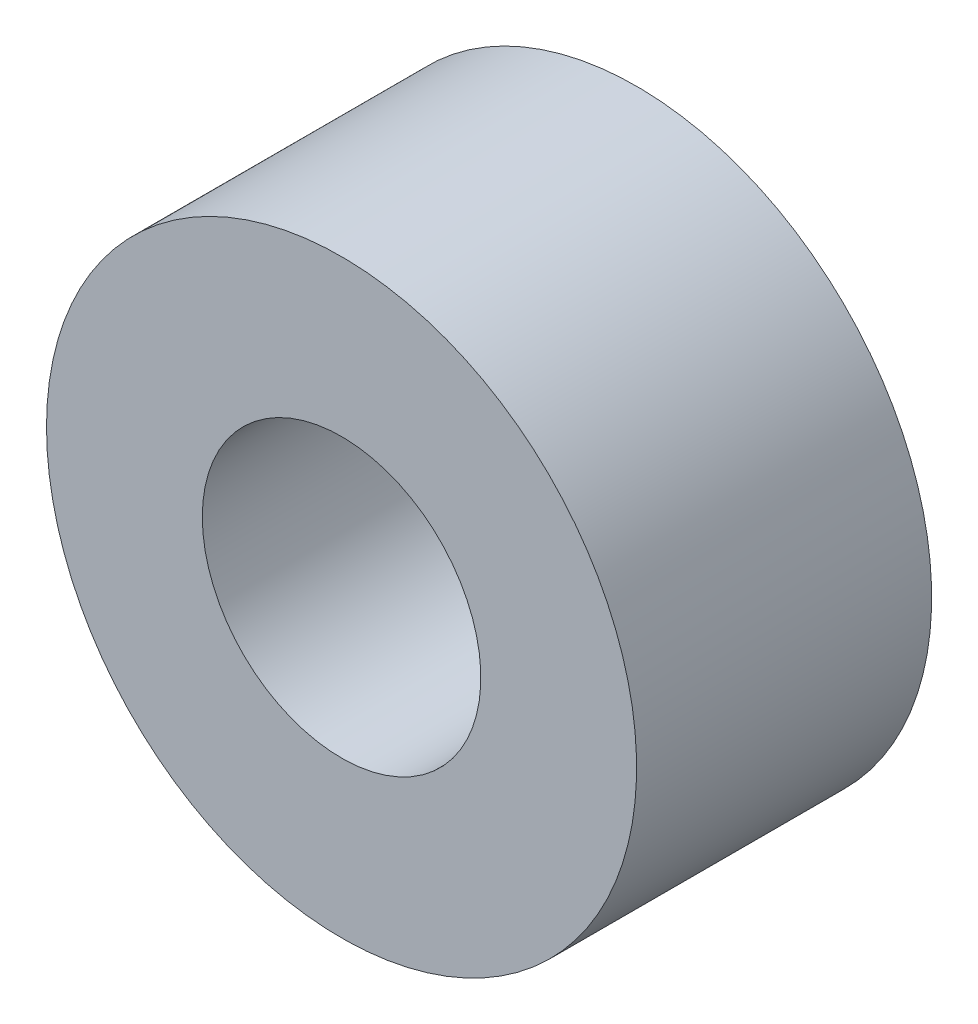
ISO-10303-21;
HEADER;
FILE_DESCRIPTION(('STEP AP214'),'2;1');
FILE_NAME('part.step','',(''),(''),'','','');
FILE_SCHEMA(('AUTOMOTIVE_DESIGN { 1 0 10303 214 1 1 1 1 }'));
ENDSEC;
DATA;
#1=APPLICATION_CONTEXT('core data for automotive mechanical design processes');
#2=APPLICATION_PROTOCOL_DEFINITION('international standard','automotive_design',2000,#1);
#3=PRODUCT_CONTEXT('',#1,'mechanical');
#4=PRODUCT('Part','Part','',(#3));
#5=PRODUCT_RELATED_PRODUCT_CATEGORY('part','',(#4));
#6=PRODUCT_DEFINITION_FORMATION('','',#4);
#7=PRODUCT_DEFINITION_CONTEXT('part definition',#1,'design');
#8=PRODUCT_DEFINITION('design','',#6,#7);
#9=PRODUCT_DEFINITION_SHAPE('','',#8);
#10=(LENGTH_UNIT() NAMED_UNIT(*) SI_UNIT(.MILLI.,.METRE.));
#11=(NAMED_UNIT(*) PLANE_ANGLE_UNIT() SI_UNIT($,.RADIAN.));
#12=(NAMED_UNIT(*) SI_UNIT($,.STERADIAN.) SOLID_ANGLE_UNIT());
#13=UNCERTAINTY_MEASURE_WITH_UNIT(LENGTH_MEASURE(1.E-05),#10,'distance_accuracy_value','');
#14=(GEOMETRIC_REPRESENTATION_CONTEXT(3) GLOBAL_UNCERTAINTY_ASSIGNED_CONTEXT((#13)) GLOBAL_UNIT_ASSIGNED_CONTEXT((#10,
#11,#12)) REPRESENTATION_CONTEXT('',''));
#15=CARTESIAN_POINT('',(0.,0.,0.));
#16=DIRECTION('',(0.,0.,1.));
#17=DIRECTION('',(1.,0.,0.));
#18=AXIS2_PLACEMENT_3D('',#15,#16,#17);
#19=CARTESIAN_POINT('',(0.,0.,-3.175));
#20=DIRECTION('',(0.,0.,1.));
#21=DIRECTION('',(1.,0.,0.));
#22=AXIS2_PLACEMENT_3D('',#19,#20,#21);
#23=CYLINDRICAL_SURFACE('',#22,3.17500475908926);
#24=CARTESIAN_POINT('',(0.,0.,-3.175));
#25=DIRECTION('',(0.,0.,-1.));
#26=DIRECTION('',(-1.,0.,0.));
#27=AXIS2_PLACEMENT_3D('',#24,#25,#26);
#28=CIRCLE('',#27,3.17500475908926);
#29=CARTESIAN_POINT('',(-3.17500475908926,0.,-3.175));
#30=VERTEX_POINT('',#29);
#31=EDGE_CURVE('E10',#30,#30,#28,.T.);
#32=ORIENTED_EDGE('',*,*,#31,.F.);
#33=EDGE_LOOP('',(#32));
#34=FACE_BOUND('',#33,.T.);
#35=CARTESIAN_POINT('',(0.,0.,0.));
#36=DIRECTION('',(0.,0.,-1.));
#37=DIRECTION('',(-1.,0.,0.));
#38=AXIS2_PLACEMENT_3D('',#35,#36,#37);
#39=CIRCLE('',#38,3.17500475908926);
#40=CARTESIAN_POINT('',(-3.17500475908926,0.,0.));
#41=VERTEX_POINT('',#40);
#42=EDGE_CURVE('E37',#41,#41,#39,.T.);
#43=ORIENTED_EDGE('',*,*,#42,.T.);
#44=EDGE_LOOP('',(#43));
#45=FACE_BOUND('',#44,.T.);
#46=ADVANCED_FACE('F34',(#34,#45),#23,.T.);
#47=CARTESIAN_POINT('',(0.,0.,-3.175));
#48=DIRECTION('',(0.,0.,-1.));
#49=DIRECTION('',(-1.,0.,0.));
#50=AXIS2_PLACEMENT_3D('',#47,#48,#49);
#51=PLANE('',#50);
#52=CARTESIAN_POINT('',(0.,0.,-3.175));
#53=DIRECTION('',(0.,0.,-1.));
#54=DIRECTION('',(-1.,0.,0.));
#55=AXIS2_PLACEMENT_3D('',#52,#53,#54);
#56=CIRCLE('',#55,1.4986);
#57=CARTESIAN_POINT('',(-1.4986,0.,-3.175));
#58=VERTEX_POINT('',#57);
#59=EDGE_CURVE('E44',#58,#58,#56,.T.);
#60=ORIENTED_EDGE('',*,*,#59,.F.);
#61=EDGE_LOOP('',(#60));
#62=FACE_BOUND('',#61,.T.);
#63=ORIENTED_EDGE('',*,*,#31,.T.);
#64=EDGE_LOOP('',(#63));
#65=FACE_BOUND('',#64,.T.);
#66=ADVANCED_FACE('F61',(#62,#65),#51,.T.);
#67=CARTESIAN_POINT('',(0.,0.,0.));
#68=DIRECTION('',(0.,0.,-1.));
#69=DIRECTION('',(-1.,0.,0.));
#70=AXIS2_PLACEMENT_3D('',#67,#68,#69);
#71=PLANE('',#70);
#72=CARTESIAN_POINT('',(0.,0.,0.));
#73=DIRECTION('',(0.,0.,-1.));
#74=DIRECTION('',(-1.,0.,0.));
#75=AXIS2_PLACEMENT_3D('',#72,#73,#74);
#76=CIRCLE('',#75,1.4986);
#77=CARTESIAN_POINT('',(-1.4986,0.,0.));
#78=VERTEX_POINT('',#77);
#79=EDGE_CURVE('E48',#78,#78,#76,.T.);
#80=ORIENTED_EDGE('',*,*,#79,.T.);
#81=EDGE_LOOP('',(#80));
#82=FACE_BOUND('',#81,.T.);
#83=ORIENTED_EDGE('',*,*,#42,.F.);
#84=EDGE_LOOP('',(#83));
#85=FACE_BOUND('',#84,.T.);
#86=ADVANCED_FACE('F52',(#82,#85),#71,.F.);
#87=CARTESIAN_POINT('',(0.,0.,-3.175));
#88=DIRECTION('',(0.,0.,-1.));
#89=DIRECTION('',(-1.,0.,0.));
#90=AXIS2_PLACEMENT_3D('',#87,#88,#89);
#91=CYLINDRICAL_SURFACE('',#90,1.4986);
#92=ORIENTED_EDGE('',*,*,#79,.F.);
#93=EDGE_LOOP('',(#92));
#94=FACE_BOUND('',#93,.T.);
#95=ORIENTED_EDGE('',*,*,#59,.T.);
#96=EDGE_LOOP('',(#95));
#97=FACE_BOUND('',#96,.T.);
#98=ADVANCED_FACE('F55',(#94,#97),#91,.F.);
#99=CLOSED_SHELL('',(#46,#66,#86,#98));
#100=MANIFOLD_SOLID_BREP('B2',#99);
#101=ADVANCED_BREP_SHAPE_REPRESENTATION('',(#18,#100),#14);
#102=SHAPE_DEFINITION_REPRESENTATION(#9,#101);
ENDSEC;
END-ISO-10303-21;
